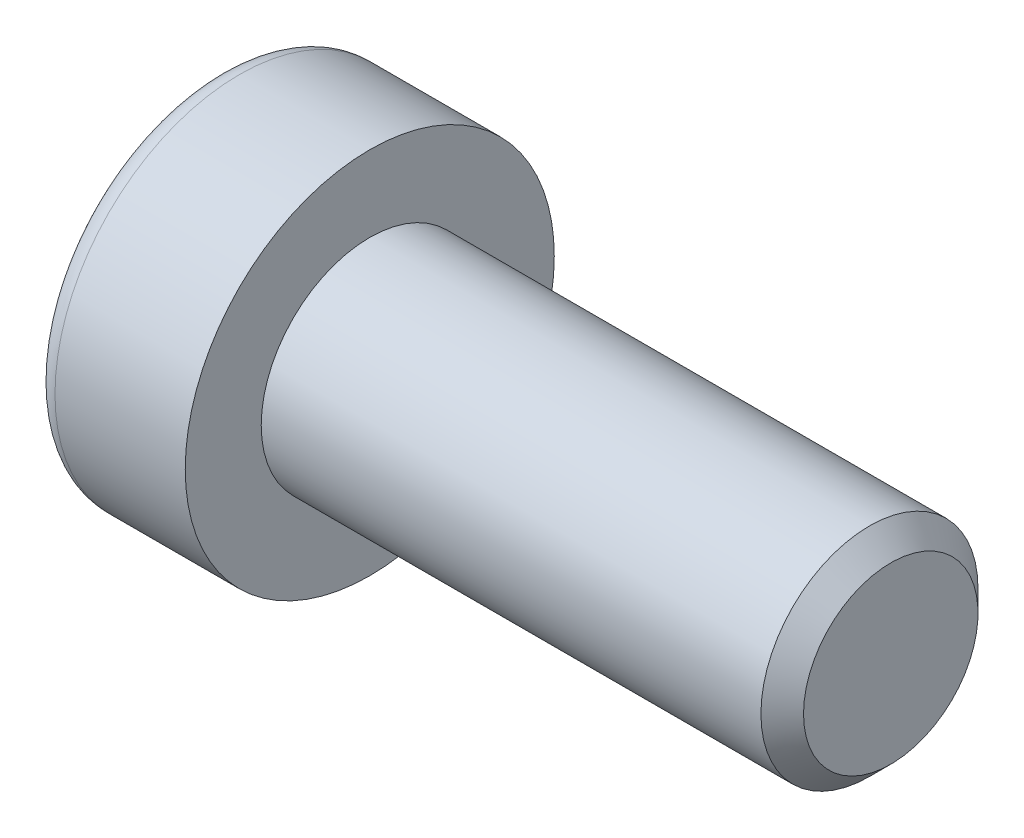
ISO-10303-21;
HEADER;
FILE_DESCRIPTION(('STEP AP214'),'2;1');
FILE_NAME('part.step','',(''),(''),'','','');
FILE_SCHEMA(('AUTOMOTIVE_DESIGN { 1 0 10303 214 1 1 1 1 }'));
ENDSEC;
DATA;
#1=APPLICATION_CONTEXT('core data for automotive mechanical design processes');
#2=APPLICATION_PROTOCOL_DEFINITION('international standard','automotive_design',2000,#1);
#3=PRODUCT_CONTEXT('',#1,'mechanical');
#4=PRODUCT('Part','Part','',(#3));
#5=PRODUCT_RELATED_PRODUCT_CATEGORY('part','',(#4));
#6=PRODUCT_DEFINITION_FORMATION('','',#4);
#7=PRODUCT_DEFINITION_CONTEXT('part definition',#1,'design');
#8=PRODUCT_DEFINITION('design','',#6,#7);
#9=PRODUCT_DEFINITION_SHAPE('','',#8);
#10=(LENGTH_UNIT() NAMED_UNIT(*) SI_UNIT(.MILLI.,.METRE.));
#11=(NAMED_UNIT(*) PLANE_ANGLE_UNIT() SI_UNIT($,.RADIAN.));
#12=(NAMED_UNIT(*) SI_UNIT($,.STERADIAN.) SOLID_ANGLE_UNIT());
#13=UNCERTAINTY_MEASURE_WITH_UNIT(LENGTH_MEASURE(1.E-05),#10,'distance_accuracy_value','');
#14=(GEOMETRIC_REPRESENTATION_CONTEXT(3) GLOBAL_UNCERTAINTY_ASSIGNED_CONTEXT((#13)) GLOBAL_UNIT_ASSIGNED_CONTEXT((#10,
#11,#12)) REPRESENTATION_CONTEXT('',''));
#15=CARTESIAN_POINT('',(0.,0.,0.));
#16=DIRECTION('',(0.,0.,1.));
#17=DIRECTION('',(1.,0.,0.));
#18=AXIS2_PLACEMENT_3D('',#15,#16,#17);
#19=CARTESIAN_POINT('',(-3.5,-1.5,0.866025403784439));
#20=DIRECTION('',(0.,-0.5,0.866025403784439));
#21=DIRECTION('',(0.,-0.866025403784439,-0.5));
#22=AXIS2_PLACEMENT_3D('',#19,#20,#21);
#23=PLANE('',#22);
#24=DIRECTION('',(1.,0.,0.));
#25=VECTOR('',#24,1.);
#26=CARTESIAN_POINT('',(-3.5,-1.5,0.866025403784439));
#27=LINE('',#26,#25);
#28=CARTESIAN_POINT('',(-0.799999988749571,-1.49999996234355,0.866025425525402));
#29=VERTEX_POINT('',#28);
#30=CARTESIAN_POINT('',(-3.5,-1.5,0.866025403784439));
#31=VERTEX_POINT('',#30);
#32=EDGE_CURVE('E79',#29,#31,#27,.F.);
#33=ORIENTED_EDGE('',*,*,#32,.T.);
#34=DIRECTION('',(0.,-0.866025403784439,-0.5));
#35=VECTOR('',#34,1.);
#36=CARTESIAN_POINT('',(-3.5,-1.5,0.866025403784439));
#37=LINE('',#36,#35);
#38=CARTESIAN_POINT('',(-3.5,0.,1.73205080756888));
#39=VERTEX_POINT('',#38);
#40=EDGE_CURVE('E91',#39,#31,#37,.T.);
#41=ORIENTED_EDGE('',*,*,#40,.F.);
#42=DIRECTION('',(1.,0.,0.));
#43=VECTOR('',#42,1.);
#44=CARTESIAN_POINT('',(-3.5,0.,1.73205080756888));
#45=LINE('',#44,#43);
#46=CARTESIAN_POINT('',(-0.799999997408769,1.16788563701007E-08,1.73205080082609));
#47=VERTEX_POINT('',#46);
#48=EDGE_CURVE('E74',#39,#47,#45,.T.);
#49=ORIENTED_EDGE('',*,*,#48,.T.);
#50=CARTESIAN_POINT('',(-0.800000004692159,-1.69050496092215E-08,1.73205077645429));
#51=CARTESIAN_POINT('',(-0.778021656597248,-0.065915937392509,1.69399421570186));
#52=CARTESIAN_POINT('',(-0.758033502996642,-0.132400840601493,1.6556091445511));
#53=CARTESIAN_POINT('',(-0.723144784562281,-0.266521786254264,1.57817438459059));
#54=CARTESIAN_POINT('',(-0.708256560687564,-0.33416021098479,1.53912332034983));
#55=CARTESIAN_POINT('',(-0.685081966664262,-0.468598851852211,1.46150513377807));
#56=CARTESIAN_POINT('',(-0.676641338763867,-0.535378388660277,1.42294995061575));
#57=CARTESIAN_POINT('',(-0.666566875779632,-0.669251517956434,1.3456582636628));
#58=CARTESIAN_POINT('',(-0.664924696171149,-0.736344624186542,1.30692204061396));
#59=CARTESIAN_POINT('',(-0.668349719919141,-0.861700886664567,1.23454756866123));
#60=CARTESIAN_POINT('',(-0.672575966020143,-0.919982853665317,1.20089845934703));
#61=CARTESIAN_POINT('',(-0.685967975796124,-1.03616709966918,1.13381945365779));
#62=CARTESIAN_POINT('',(-0.695138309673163,-1.09406897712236,1.10038978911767));
#63=CARTESIAN_POINT('',(-0.718062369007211,-1.21049257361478,1.03317259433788));
#64=CARTESIAN_POINT('',(-0.731913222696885,-1.26899956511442,0.999393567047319));
#65=CARTESIAN_POINT('',(-0.763348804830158,-1.3851411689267,0.932339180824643));
#66=CARTESIAN_POINT('',(-0.780926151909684,-1.44277726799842,0.899062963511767));
#67=CARTESIAN_POINT('',(-0.799999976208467,-1.49999992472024,0.866025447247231));
#68=B_SPLINE_CURVE_WITH_KNOTS('',3,(#50,#51,#52,#53,#54,#55,#56,#57,#58,#59,#60,#61,#62,#63,#64,
#65,#66,#67),.UNSPECIFIED.,.F.,.F.,(4,2,2,2,2,2,2,2,4),(0.,0.237762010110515,0.476095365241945,
0.708530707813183,0.940680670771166,1.14278081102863,1.34506808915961,1.551841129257,
1.75820836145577),.UNSPECIFIED.);
#69=EDGE_CURVE('E20',#47,#29,#68,.T.);
#70=ORIENTED_EDGE('',*,*,#69,.T.);
#71=EDGE_LOOP('',(#33,#41,#49,#70));
#72=FACE_BOUND('',#71,.T.);
#73=ADVANCED_FACE('F16',(#72),#23,.F.);
#74=CARTESIAN_POINT('',(-3.5,-1.5,-0.866025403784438));
#75=DIRECTION('',(0.,-1.,0.));
#76=DIRECTION('',(0.,0.,-1.));
#77=AXIS2_PLACEMENT_3D('',#74,#75,#76);
#78=PLANE('',#77);
#79=DIRECTION('',(1.,0.,0.));
#80=VECTOR('',#79,1.);
#81=CARTESIAN_POINT('',(-3.5,-1.5,-0.866025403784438));
#82=LINE('',#81,#80);
#83=CARTESIAN_POINT('',(-0.799999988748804,-1.5,-0.866025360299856));
#84=VERTEX_POINT('',#83);
#85=CARTESIAN_POINT('',(-3.5,-1.5,-0.866025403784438));
#86=VERTEX_POINT('',#85);
#87=EDGE_CURVE('E218',#84,#86,#82,.F.);
#88=ORIENTED_EDGE('',*,*,#87,.T.);
#89=DIRECTION('',(0.,0.,-1.));
#90=VECTOR('',#89,1.);
#91=CARTESIAN_POINT('',(-3.5,-1.5,-0.866025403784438));
#92=LINE('',#91,#90);
#93=EDGE_CURVE('E90',#31,#86,#92,.T.);
#94=ORIENTED_EDGE('',*,*,#93,.F.);
#95=ORIENTED_EDGE('',*,*,#32,.F.);
#96=CARTESIAN_POINT('',(-0.800000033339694,-1.49999996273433,0.866025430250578));
#97=CARTESIAN_POINT('',(-0.77802167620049,-1.49999998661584,0.78991228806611));
#98=CARTESIAN_POINT('',(-0.758033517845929,-1.49999999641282,0.71314213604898));
#99=CARTESIAN_POINT('',(-0.723144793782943,-1.5000000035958,0.558272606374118));
#100=CARTESIAN_POINT('',(-0.708256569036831,-1.50000000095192,0.480170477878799));
#101=CARTESIAN_POINT('',(-0.685081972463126,-1.49999999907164,0.324934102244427));
#102=CARTESIAN_POINT('',(-0.676641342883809,-1.49999999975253,0.247823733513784));
#103=CARTESIAN_POINT('',(-0.666566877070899,-1.50000000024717,0.0932403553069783));
#104=CARTESIAN_POINT('',(-0.664924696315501,-1.50000000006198,0.0157679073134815));
#105=CARTESIAN_POINT('',(-0.668349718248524,-1.49999999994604,-0.128981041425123));
#106=CARTESIAN_POINT('',(-0.672575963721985,-1.49999999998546,-0.196279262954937));
#107=CARTESIAN_POINT('',(-0.685967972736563,-1.50000000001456,-0.330437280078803));
#108=CARTESIAN_POINT('',(-0.695138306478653,-1.5000000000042,-0.397296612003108));
#109=CARTESIAN_POINT('',(-0.718062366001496,-1.49999999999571,-0.531731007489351));
#110=CARTESIAN_POINT('',(-0.731913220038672,-1.49999999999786,-0.599289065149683));
#111=CARTESIAN_POINT('',(-0.763348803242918,-1.50000000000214,-0.733397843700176));
#112=CARTESIAN_POINT('',(-0.780926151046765,-1.50000000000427,-0.799950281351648));
#113=CARTESIAN_POINT('',(-0.799999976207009,-1.5,-0.866025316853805));
#114=B_SPLINE_CURVE_WITH_KNOTS('',3,(#96,#97,#98,#99,#100,#101,#102,#103,#104,#105,#106,#107,
#108,#109,#110,#111,#112,#113),.UNSPECIFIED.,.F.,.F.,(4,2,2,2,2,2,2,2,4),(0.,0.237762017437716,
0.476095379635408,0.708530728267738,0.940680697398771,1.14278084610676,1.34506813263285,
1.55184118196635,1.75820842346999),.UNSPECIFIED.);
#115=EDGE_CURVE('E84',#29,#84,#114,.T.);
#116=ORIENTED_EDGE('',*,*,#115,.T.);
#117=EDGE_LOOP('',(#88,#94,#95,#116));
#118=FACE_BOUND('',#117,.T.);
#119=ADVANCED_FACE('F88',(#118),#78,.F.);
#120=CARTESIAN_POINT('',(-3.5,0.,1.73205080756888));
#121=DIRECTION('',(0.,0.500000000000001,0.866025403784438));
#122=DIRECTION('',(0.,-0.866025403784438,0.500000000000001));
#123=AXIS2_PLACEMENT_3D('',#120,#121,#122);
#124=PLANE('',#123);
#125=ORIENTED_EDGE('',*,*,#48,.F.);
#126=DIRECTION('',(0.,-0.866025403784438,0.500000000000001));
#127=VECTOR('',#126,1.);
#128=CARTESIAN_POINT('',(-3.5,0.,1.73205080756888));
#129=LINE('',#128,#127);
#130=CARTESIAN_POINT('',(-3.5,1.5,0.866025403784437));
#131=VERTEX_POINT('',#130);
#132=EDGE_CURVE('E221',#131,#39,#129,.T.);
#133=ORIENTED_EDGE('',*,*,#132,.F.);
#134=DIRECTION('',(1.,0.,0.));
#135=VECTOR('',#134,1.);
#136=CARTESIAN_POINT('',(-3.5,1.5,0.866025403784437));
#137=LINE('',#136,#135);
#138=CARTESIAN_POINT('',(-0.799999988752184,1.5,0.866025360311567));
#139=VERTEX_POINT('',#138);
#140=EDGE_CURVE('E85',#131,#139,#137,.T.);
#141=ORIENTED_EDGE('',*,*,#140,.T.);
#142=CARTESIAN_POINT('',(-0.800000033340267,1.50000000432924,0.866025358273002));
#143=CARTESIAN_POINT('',(-0.77802167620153,1.434084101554,0.904081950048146));
#144=CARTESIAN_POINT('',(-0.758033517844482,1.36759920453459,0.942467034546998));
#145=CARTESIAN_POINT('',(-0.723144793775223,1.23347826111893,1.01990180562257));
#146=CARTESIAN_POINT('',(-0.708256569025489,1.16583983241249,1.05895286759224));
#147=CARTESIAN_POINT('',(-0.685081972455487,1.03140118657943,1.13657105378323));
#148=CARTESIAN_POINT('',(-0.676641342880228,0.964621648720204,1.17512623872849));
#149=CARTESIAN_POINT('',(-0.666566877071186,0.830748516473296,1.25241792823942));
#150=CARTESIAN_POINT('',(-0.664924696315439,0.763655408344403,1.29115415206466));
#151=CARTESIAN_POINT('',(-0.668349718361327,0.638299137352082,1.36352862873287));
#152=CARTESIAN_POINT('',(-0.672575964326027,0.580017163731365,1.39717774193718));
#153=CARTESIAN_POINT('',(-0.6859679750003,0.463832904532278,1.46425675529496));
#154=CARTESIAN_POINT('',(-0.695138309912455,0.40593102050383,1.49768642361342));
#155=CARTESIAN_POINT('',(-0.718062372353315,0.289507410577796,1.56490362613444));
#156=CARTESIAN_POINT('',(-0.73191322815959,0.231000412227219,1.5986826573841));
#157=CARTESIAN_POINT('',(-0.763348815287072,0.11485879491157,1.66573705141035));
#158=CARTESIAN_POINT('',(-0.780926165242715,0.0572226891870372,1.69901327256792));
#159=CARTESIAN_POINT('',(-0.799999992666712,2.59050250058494E-08,1.7320507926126));
#160=B_SPLINE_CURVE_WITH_KNOTS('',3,(#142,#143,#144,#145,#146,#147,#148,#149,#150,#151,#152,
#153,#154,#155,#156,#157,#158,#159),.UNSPECIFIED.,.F.,.F.,(4,2,2,2,2,2,2,2,4),(0.,
0.237762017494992,0.476095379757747,0.708530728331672,0.940680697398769,1.14278086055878,
1.34506816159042,1.55184122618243,1.7582084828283),.UNSPECIFIED.);
#161=EDGE_CURVE('E121',#139,#47,#160,.T.);
#162=ORIENTED_EDGE('',*,*,#161,.T.);
#163=EDGE_LOOP('',(#125,#133,#141,#162));
#164=FACE_BOUND('',#163,.T.);
#165=ADVANCED_FACE('F114',(#164),#124,.F.);
#166=CARTESIAN_POINT('',(-3.5,0.,-1.73205080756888));
#167=DIRECTION('',(0.,-0.5,-0.866025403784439));
#168=DIRECTION('',(0.,0.866025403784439,-0.5));
#169=AXIS2_PLACEMENT_3D('',#166,#167,#168);
#170=PLANE('',#169);
#171=DIRECTION('',(1.,0.,0.));
#172=VECTOR('',#171,1.);
#173=CARTESIAN_POINT('',(-3.5,0.,-1.73205080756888));
#174=LINE('',#173,#172);
#175=CARTESIAN_POINT('',(-0.799999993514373,-5.19201455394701E-08,-1.73205079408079));
#176=VERTEX_POINT('',#175);
#177=CARTESIAN_POINT('',(-3.5,0.,-1.73205080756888));
#178=VERTEX_POINT('',#177);
#179=EDGE_CURVE('E126',#176,#178,#174,.F.);
#180=ORIENTED_EDGE('',*,*,#179,.T.);
#181=DIRECTION('',(0.,0.866025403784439,-0.5));
#182=VECTOR('',#181,1.);
#183=CARTESIAN_POINT('',(-3.5,0.,-1.73205080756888));
#184=LINE('',#183,#182);
#185=EDGE_CURVE('E39',#86,#178,#184,.T.);
#186=ORIENTED_EDGE('',*,*,#185,.F.);
#187=ORIENTED_EDGE('',*,*,#87,.F.);
#188=CARTESIAN_POINT('',(-0.800000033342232,-1.50000000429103,-0.866025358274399));
#189=CARTESIAN_POINT('',(-0.778021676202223,-1.43408410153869,-0.904081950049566));
#190=CARTESIAN_POINT('',(-0.758033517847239,-1.36759920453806,-0.942467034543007));
#191=CARTESIAN_POINT('',(-0.723144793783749,-1.23347826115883,-1.01990180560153));
#192=CARTESIAN_POINT('',(-0.708256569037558,-1.16583983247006,-1.05895286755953));
#193=CARTESIAN_POINT('',(-0.685081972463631,-1.03140118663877,-1.13657105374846));
#194=CARTESIAN_POINT('',(-0.676641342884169,-0.96462164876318,-1.17512623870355));
#195=CARTESIAN_POINT('',(-0.666566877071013,-0.83074851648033,-1.2524179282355));
#196=CARTESIAN_POINT('',(-0.664924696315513,-0.763655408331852,-1.29115415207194));
#197=CARTESIAN_POINT('',(-0.668349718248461,-0.638299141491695,-1.36352862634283));
#198=CARTESIAN_POINT('',(-0.672575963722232,-0.580017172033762,-1.39717773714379));
#199=CARTESIAN_POINT('',(-0.685967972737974,-0.463832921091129,-1.46425674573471));
#200=CARTESIAN_POINT('',(-0.69513830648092,-0.405931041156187,-1.49768641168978));
#201=CARTESIAN_POINT('',(-0.718062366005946,-0.28950743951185,-1.56490360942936));
#202=CARTESIAN_POINT('',(-0.731913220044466,-0.2310004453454,-1.59868263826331));
#203=CARTESIAN_POINT('',(-0.763348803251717,-0.114858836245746,-1.66573702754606));
#204=CARTESIAN_POINT('',(-0.780926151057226,-0.0572227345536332,-1.69901324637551));
#205=CARTESIAN_POINT('',(-0.799999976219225,-7.52474889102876E-08,-1.73205076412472));
#206=B_SPLINE_CURVE_WITH_KNOTS('',3,(#188,#189,#190,#191,#192,#193,#194,#195,#196,#197,#198,
#199,#200,#201,#202,#203,#204,#205),.UNSPECIFIED.,.F.,.F.,(4,2,2,2,2,2,2,2,4),(0.,
0.237762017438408,0.476095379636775,0.708530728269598,0.94068069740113,1.14278084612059,
1.34506813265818,1.55184118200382,1.75820842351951),.UNSPECIFIED.);
#207=EDGE_CURVE('E97',#84,#176,#206,.T.);
#208=ORIENTED_EDGE('',*,*,#207,.T.);
#209=EDGE_LOOP('',(#180,#186,#187,#208));
#210=FACE_BOUND('',#209,.T.);
#211=ADVANCED_FACE('F117',(#210),#170,.F.);
#212=CARTESIAN_POINT('',(-3.5,1.5,0.866025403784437));
#213=DIRECTION('',(0.,1.,0.));
#214=DIRECTION('',(0.,0.,1.));
#215=AXIS2_PLACEMENT_3D('',#212,#213,#214);
#216=PLANE('',#215);
#217=ORIENTED_EDGE('',*,*,#140,.F.);
#218=DIRECTION('',(0.,0.,1.));
#219=VECTOR('',#218,1.);
#220=CARTESIAN_POINT('',(-3.5,1.5,0.866025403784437));
#221=LINE('',#220,#219);
#222=CARTESIAN_POINT('',(-3.5,1.5,-0.866025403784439));
#223=VERTEX_POINT('',#222);
#224=EDGE_CURVE('E214',#223,#131,#221,.T.);
#225=ORIENTED_EDGE('',*,*,#224,.F.);
#226=DIRECTION('',(1.,0.,0.));
#227=VECTOR('',#226,1.);
#228=CARTESIAN_POINT('',(-3.5,1.5,-0.866025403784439));
#229=LINE('',#228,#227);
#230=CARTESIAN_POINT('',(-0.800000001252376,1.5,-0.866025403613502));
#231=VERTEX_POINT('',#230);
#232=EDGE_CURVE('E205',#223,#231,#229,.T.);
#233=ORIENTED_EDGE('',*,*,#232,.T.);
#234=CARTESIAN_POINT('',(-0.800000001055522,1.50000000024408,-0.866025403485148));
#235=CARTESIAN_POINT('',(-0.778021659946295,1.50000000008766,-0.789912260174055));
#236=CARTESIAN_POINT('',(-0.758033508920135,1.5000000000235,-0.713142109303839));
#237=CARTESIAN_POINT('',(-0.723144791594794,1.49999999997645,-0.558272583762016));
#238=CARTESIAN_POINT('',(-0.708256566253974,1.49999999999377,-0.480170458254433));
#239=CARTESIAN_POINT('',(-0.68508197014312,1.50000000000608,-0.324934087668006));
#240=CARTESIAN_POINT('',(-0.676641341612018,1.50000000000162,-0.24782372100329));
#241=CARTESIAN_POINT('',(-0.666566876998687,1.49999999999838,-0.0932403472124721));
#242=CARTESIAN_POINT('',(-0.664924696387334,1.49999999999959,-0.0157679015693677));
#243=CARTESIAN_POINT('',(-0.668349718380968,1.50000000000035,0.128981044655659));
#244=CARTESIAN_POINT('',(-0.672575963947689,1.5000000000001,0.196279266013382));
#245=CARTESIAN_POINT('',(-0.685967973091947,1.4999999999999,0.330437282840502));
#246=CARTESIAN_POINT('',(-0.69513830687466,1.49999999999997,0.397296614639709));
#247=CARTESIAN_POINT('',(-0.71806236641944,1.50000000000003,0.531731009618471));
#248=CARTESIAN_POINT('',(-0.731913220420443,1.50000000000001,0.599289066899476));
#249=CARTESIAN_POINT('',(-0.763348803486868,1.49999999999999,0.73339784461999));
#250=CARTESIAN_POINT('',(-0.780926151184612,1.49999999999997,0.799950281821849));
#251=CARTESIAN_POINT('',(-0.799999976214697,1.5,0.866025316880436));
#252=B_SPLINE_CURVE_WITH_KNOTS('',3,(#234,#235,#236,#237,#238,#239,#240,#241,#242,#243,#244,
#245,#246,#247,#248,#249,#250,#251),.UNSPECIFIED.,.F.,.F.,(4,2,2,2,2,2,2,2,4),(0.,
0.237762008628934,0.476095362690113,0.708530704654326,0.940680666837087,1.14278081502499,
1.34506810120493,1.55184114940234,1.75820838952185),.UNSPECIFIED.);
#253=EDGE_CURVE('E98',#231,#139,#252,.T.);
#254=ORIENTED_EDGE('',*,*,#253,.T.);
#255=EDGE_LOOP('',(#217,#225,#233,#254));
#256=FACE_BOUND('',#255,.T.);
#257=ADVANCED_FACE('F136',(#256),#216,.F.);
#258=CARTESIAN_POINT('',(-0.806000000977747,0.,0.));
#259=DIRECTION('',(-1.,0.,0.));
#260=DIRECTION('',(0.,0.,1.));
#261=AXIS2_PLACEMENT_3D('',#258,#259,#260);
#262=CONICAL_SURFACE('',#261,1.74244311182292,1.04719754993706);
#263=CARTESIAN_POINT('',(0.200000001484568,0.,0.));
#264=VERTEX_POINT('',#263);
#265=VERTEX_LOOP('',#264);
#266=FACE_BOUND('',#265,.T.);
#267=ORIENTED_EDGE('',*,*,#253,.F.);
#268=CARTESIAN_POINT('',(-0.80000000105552,1.49999999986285,-0.866025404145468));
#269=CARTESIAN_POINT('',(-0.778021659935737,1.43408408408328,-0.904081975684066));
#270=CARTESIAN_POINT('',(-0.758033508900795,1.36759918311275,-0.942467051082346));
#271=CARTESIAN_POINT('',(-0.723144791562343,1.23347823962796,-1.01990181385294));
#272=CARTESIAN_POINT('',(-0.70825656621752,1.16583981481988,-1.05895287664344));
#273=CARTESIAN_POINT('',(-0.685081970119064,1.03140117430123,-1.13657106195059));
#274=CARTESIAN_POINT('',(-0.676641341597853,0.964621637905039,-1.17512624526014));
#275=CARTESIAN_POINT('',(-0.666566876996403,0.830748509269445,-1.25241793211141));
#276=CARTESIAN_POINT('',(-0.664924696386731,0.763655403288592,-1.29115415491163));
#277=CARTESIAN_POINT('',(-0.668349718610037,0.638299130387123,-1.36352863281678));
#278=CARTESIAN_POINT('',(-0.672575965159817,0.580017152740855,-1.39717774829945));
#279=CARTESIAN_POINT('',(-0.685967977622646,0.463832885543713,-1.4642567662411));
#280=CARTESIAN_POINT('',(-0.695138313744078,0.40593099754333,-1.49768643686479));
#281=CARTESIAN_POINT('',(-0.718062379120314,0.289507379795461,-1.56490364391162));
#282=CARTESIAN_POINT('',(-0.731913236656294,0.231000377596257,-1.59868267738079));
#283=CARTESIAN_POINT('',(-0.763348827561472,0.114858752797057,-1.6657370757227));
#284=CARTESIAN_POINT('',(-0.780926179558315,0.0572226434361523,-1.69901329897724));
#285=CARTESIAN_POINT('',(-0.80000000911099,-2.3427808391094E-08,-1.73205082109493));
#286=B_SPLINE_CURVE_WITH_KNOTS('',3,(#268,#269,#270,#271,#272,#273,#274,#275,#276,#277,#278,
#279,#280,#281,#282,#283,#284,#285),.UNSPECIFIED.,.F.,.F.,(4,2,2,2,2,2,2,2,4),(0.,
0.237762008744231,0.476095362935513,0.708530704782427,0.940680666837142,1.14278084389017,
1.34506815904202,1.55184123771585,1.75820850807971),.UNSPECIFIED.);
#287=EDGE_CURVE('E127',#231,#176,#286,.T.);
#288=ORIENTED_EDGE('',*,*,#287,.T.);
#289=ORIENTED_EDGE('',*,*,#207,.F.);
#290=ORIENTED_EDGE('',*,*,#115,.F.);
#291=ORIENTED_EDGE('',*,*,#69,.F.);
#292=ORIENTED_EDGE('',*,*,#161,.F.);
#293=EDGE_LOOP('',(#267,#288,#289,#290,#291,#292));
#294=FACE_BOUND('',#293,.T.);
#295=ADVANCED_FACE('F95',(#266,#294),#262,.F.);
#296=CARTESIAN_POINT('',(-3.5,1.5,-0.866025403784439));
#297=DIRECTION('',(0.,0.5,-0.866025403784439));
#298=DIRECTION('',(0.,0.866025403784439,0.5));
#299=AXIS2_PLACEMENT_3D('',#296,#297,#298);
#300=PLANE('',#299);
#301=ORIENTED_EDGE('',*,*,#232,.F.);
#302=DIRECTION('',(0.,0.866025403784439,0.5));
#303=VECTOR('',#302,1.);
#304=CARTESIAN_POINT('',(-3.5,0.,-1.73205080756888));
#305=LINE('',#304,#303);
#306=EDGE_CURVE('E216',#178,#223,#305,.T.);
#307=ORIENTED_EDGE('',*,*,#306,.F.);
#308=ORIENTED_EDGE('',*,*,#179,.F.);
#309=ORIENTED_EDGE('',*,*,#287,.F.);
#310=EDGE_LOOP('',(#301,#307,#308,#309));
#311=FACE_BOUND('',#310,.T.);
#312=ADVANCED_FACE('F145',(#311),#300,.F.);
#313=CARTESIAN_POINT('',(-3.5,2.99102540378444,0.));
#314=DIRECTION('',(-1.,0.,0.));
#315=DIRECTION('',(0.,0.,1.));
#316=AXIS2_PLACEMENT_3D('',#313,#314,#315);
#317=PLANE('',#316);
#318=ORIENTED_EDGE('',*,*,#185,.T.);
#319=ORIENTED_EDGE('',*,*,#306,.T.);
#320=ORIENTED_EDGE('',*,*,#224,.T.);
#321=ORIENTED_EDGE('',*,*,#132,.T.);
#322=ORIENTED_EDGE('',*,*,#40,.T.);
#323=ORIENTED_EDGE('',*,*,#93,.T.);
#324=EDGE_LOOP('',(#318,#319,#320,#321,#322,#323));
#325=FACE_BOUND('',#324,.T.);
#326=CARTESIAN_POINT('',(-3.5,0.,0.));
#327=DIRECTION('',(1.,0.,0.));
#328=DIRECTION('',(0.,1.,0.));
#329=AXIS2_PLACEMENT_3D('',#326,#327,#328);
#330=CIRCLE('',#329,3.75);
#331=CARTESIAN_POINT('',(-3.5,3.75,0.));
#332=VERTEX_POINT('',#331);
#333=EDGE_CURVE('E192',#332,#332,#330,.T.);
#334=ORIENTED_EDGE('',*,*,#333,.F.);
#335=EDGE_LOOP('',(#334));
#336=FACE_BOUND('',#335,.T.);
#337=ADVANCED_FACE('F179',(#325,#336),#317,.T.);
#338=CARTESIAN_POINT('',(-3.,0.,0.));
#339=DIRECTION('',(1.,0.,0.));
#340=DIRECTION('',(0.,0.,-1.));
#341=AXIS2_PLACEMENT_3D('',#338,#339,#340);
#342=TOROIDAL_SURFACE('',#341,3.75,0.5);
#343=CARTESIAN_POINT('',(-3.,0.,0.));
#344=DIRECTION('',(1.,0.,0.));
#345=DIRECTION('',(0.,1.,0.));
#346=AXIS2_PLACEMENT_3D('',#343,#344,#345);
#347=CIRCLE('',#346,4.25);
#348=CARTESIAN_POINT('',(-3.,4.25,0.));
#349=VERTEX_POINT('',#348);
#350=EDGE_CURVE('E232',#349,#349,#347,.T.);
#351=ORIENTED_EDGE('',*,*,#350,.F.);
#352=EDGE_LOOP('',(#351));
#353=FACE_BOUND('',#352,.T.);
#354=ORIENTED_EDGE('',*,*,#333,.T.);
#355=EDGE_LOOP('',(#354));
#356=FACE_BOUND('',#355,.T.);
#357=ADVANCED_FACE('F173',(#353,#356),#342,.T.);
#358=CARTESIAN_POINT('',(-1.75,0.,0.));
#359=DIRECTION('',(1.,0.,0.));
#360=DIRECTION('',(0.,1.,0.));
#361=AXIS2_PLACEMENT_3D('',#358,#359,#360);
#362=CYLINDRICAL_SURFACE('',#361,4.25);
#363=ORIENTED_EDGE('',*,*,#350,.T.);
#364=EDGE_LOOP('',(#363));
#365=FACE_BOUND('',#364,.T.);
#366=CARTESIAN_POINT('',(0.,0.,0.));
#367=DIRECTION('',(1.,0.,0.));
#368=DIRECTION('',(0.,1.,0.));
#369=AXIS2_PLACEMENT_3D('',#366,#367,#368);
#370=CIRCLE('',#369,4.25);
#371=CARTESIAN_POINT('',(0.,4.25,0.));
#372=VERTEX_POINT('',#371);
#373=EDGE_CURVE('E230',#372,#372,#370,.T.);
#374=ORIENTED_EDGE('',*,*,#373,.F.);
#375=EDGE_LOOP('',(#374));
#376=FACE_BOUND('',#375,.T.);
#377=ADVANCED_FACE('F169',(#365,#376),#362,.T.);
#378=CARTESIAN_POINT('',(12.,1.25,0.));
#379=DIRECTION('',(1.,0.,0.));
#380=DIRECTION('',(0.,0.,-1.));
#381=AXIS2_PLACEMENT_3D('',#378,#379,#380);
#382=PLANE('',#381);
#383=CARTESIAN_POINT('',(12.000000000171,0.,0.));
#384=DIRECTION('',(-1.,0.,0.));
#385=DIRECTION('',(0.,0.,1.));
#386=AXIS2_PLACEMENT_3D('',#383,#384,#385);
#387=CIRCLE('',#386,2.00924000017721);
#388=CARTESIAN_POINT('',(12.000000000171,0.,2.00924000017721));
#389=VERTEX_POINT('',#388);
#390=EDGE_CURVE('E228',#389,#389,#387,.T.);
#391=ORIENTED_EDGE('',*,*,#390,.F.);
#392=EDGE_LOOP('',(#391));
#393=FACE_BOUND('',#392,.T.);
#394=ADVANCED_FACE('F165',(#393),#382,.T.);
#395=CARTESIAN_POINT('',(0.,3.375,0.));
#396=DIRECTION('',(1.,0.,0.));
#397=DIRECTION('',(0.,0.,-1.));
#398=AXIS2_PLACEMENT_3D('',#395,#396,#397);
#399=PLANE('',#398);
#400=CARTESIAN_POINT('',(0.,0.,0.));
#401=DIRECTION('',(1.,0.,0.));
#402=DIRECTION('',(0.,1.,0.));
#403=AXIS2_PLACEMENT_3D('',#400,#401,#402);
#404=CIRCLE('',#403,2.5);
#405=CARTESIAN_POINT('',(0.,2.5,0.));
#406=VERTEX_POINT('',#405);
#407=EDGE_CURVE('E30',#406,#406,#404,.T.);
#408=ORIENTED_EDGE('',*,*,#407,.F.);
#409=EDGE_LOOP('',(#408));
#410=FACE_BOUND('',#409,.T.);
#411=ORIENTED_EDGE('',*,*,#373,.T.);
#412=EDGE_LOOP('',(#411));
#413=FACE_BOUND('',#412,.T.);
#414=ADVANCED_FACE('F158',(#410,#413),#399,.T.);
#415=CARTESIAN_POINT('',(11.5092399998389,0.,0.));
#416=DIRECTION('',(-1.,0.,0.));
#417=DIRECTION('',(0.,0.,1.));
#418=AXIS2_PLACEMENT_3D('',#415,#416,#417);
#419=CONICAL_SURFACE('',#418,2.49999999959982,0.78539816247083);
#420=ORIENTED_EDGE('',*,*,#390,.T.);
#421=EDGE_LOOP('',(#420));
#422=FACE_BOUND('',#421,.T.);
#423=CARTESIAN_POINT('',(11.50924,0.,0.));
#424=DIRECTION('',(1.,0.,0.));
#425=DIRECTION('',(0.,1.,0.));
#426=AXIS2_PLACEMENT_3D('',#423,#424,#425);
#427=CIRCLE('',#426,2.5);
#428=CARTESIAN_POINT('',(11.50924,2.5,0.));
#429=VERTEX_POINT('',#428);
#430=EDGE_CURVE('E11',#429,#429,#427,.F.);
#431=ORIENTED_EDGE('',*,*,#430,.F.);
#432=EDGE_LOOP('',(#431));
#433=FACE_BOUND('',#432,.T.);
#434=ADVANCED_FACE('F151',(#422,#433),#419,.T.);
#435=CARTESIAN_POINT('',(7.2,0.,0.));
#436=DIRECTION('',(1.,0.,0.));
#437=DIRECTION('',(0.,1.,0.));
#438=AXIS2_PLACEMENT_3D('',#435,#436,#437);
#439=CYLINDRICAL_SURFACE('',#438,2.5);
#440=ORIENTED_EDGE('',*,*,#430,.T.);
#441=EDGE_LOOP('',(#440));
#442=FACE_BOUND('',#441,.T.);
#443=ORIENTED_EDGE('',*,*,#407,.T.);
#444=EDGE_LOOP('',(#443));
#445=FACE_BOUND('',#444,.T.);
#446=ADVANCED_FACE('F149',(#442,#445),#439,.T.);
#447=CLOSED_SHELL('',(#73,#119,#165,#211,#257,#295,#312,#337,#357,#377,#394,#414,#434,#446));
#448=MANIFOLD_SOLID_BREP('B1',#447);
#449=ADVANCED_BREP_SHAPE_REPRESENTATION('',(#18,#448),#14);
#450=SHAPE_DEFINITION_REPRESENTATION(#9,#449);
ENDSEC;
END-ISO-10303-21;
